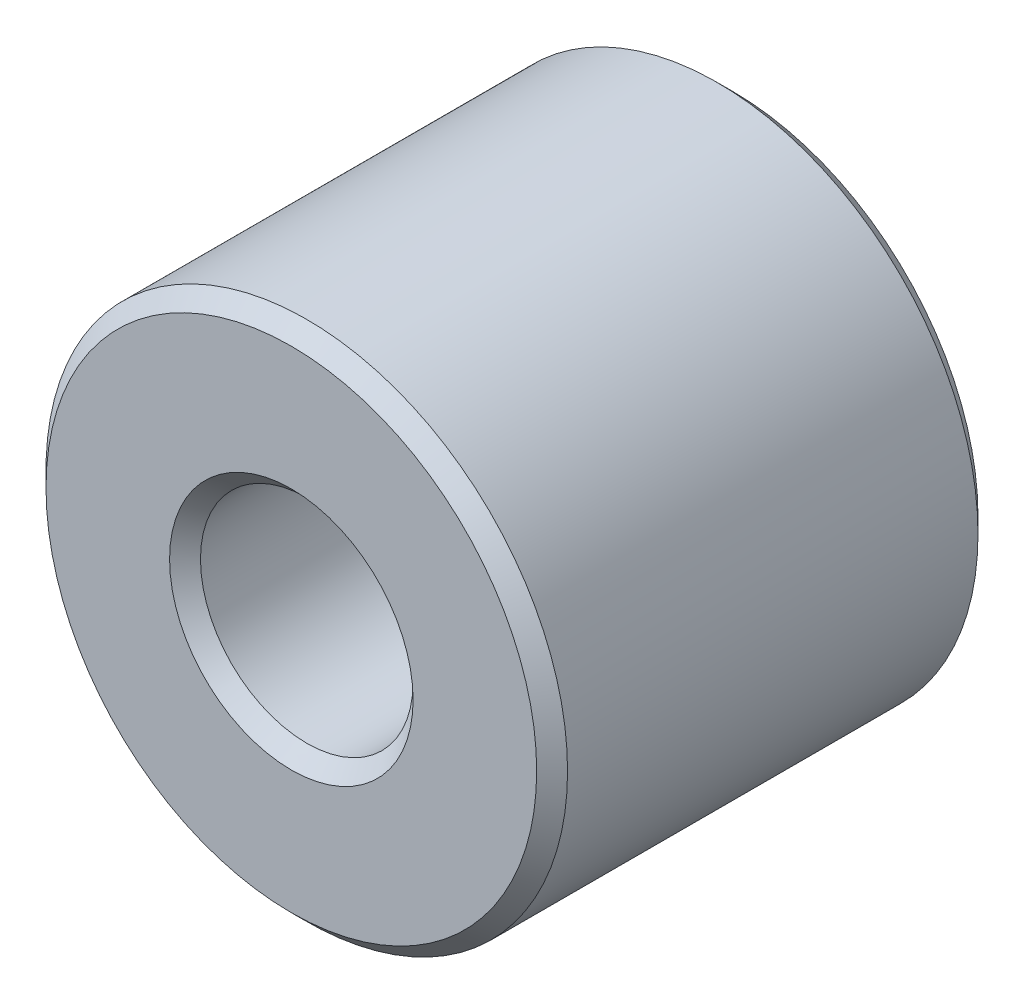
from build123d import *

# Parameters (mm, degrees)
BOSS_EXTRUDE1_DEPTH      = 5.5
BOSS_EXTRUDE1_DEPTH_BACK = 5.5
SKETCH3_R                = 6.5
SKETCH3_R_2              = 2.65
CHAMFER1_SIZE            = 0.385


with BuildPart() as part:
    # Sketch3 → Boss-Extrude1 (new, two sides: drawn at the far end of the back side and taken through both)
    with BuildSketch(Plane.XY.offset(-BOSS_EXTRUDE1_DEPTH_BACK)):
        Circle(SKETCH3_R)
        Circle(SKETCH3_R_2, mode=Mode.SUBTRACT)
    extrude(amount=BOSS_EXTRUDE1_DEPTH + BOSS_EXTRUDE1_DEPTH_BACK)

    # Chamfer1
    chamfer1_edges = [part.edges().sort_by_distance(p)[0] for p in [
        (-6.5, 0, -5.5),
        (-2.65, 0, -5.5),
        (-6.5, 0, 5.5),
        (-2.65, 0, 5.5),
    ]]
    chamfer(chamfer1_edges, length=CHAMFER1_SIZE)


solid = part.part
